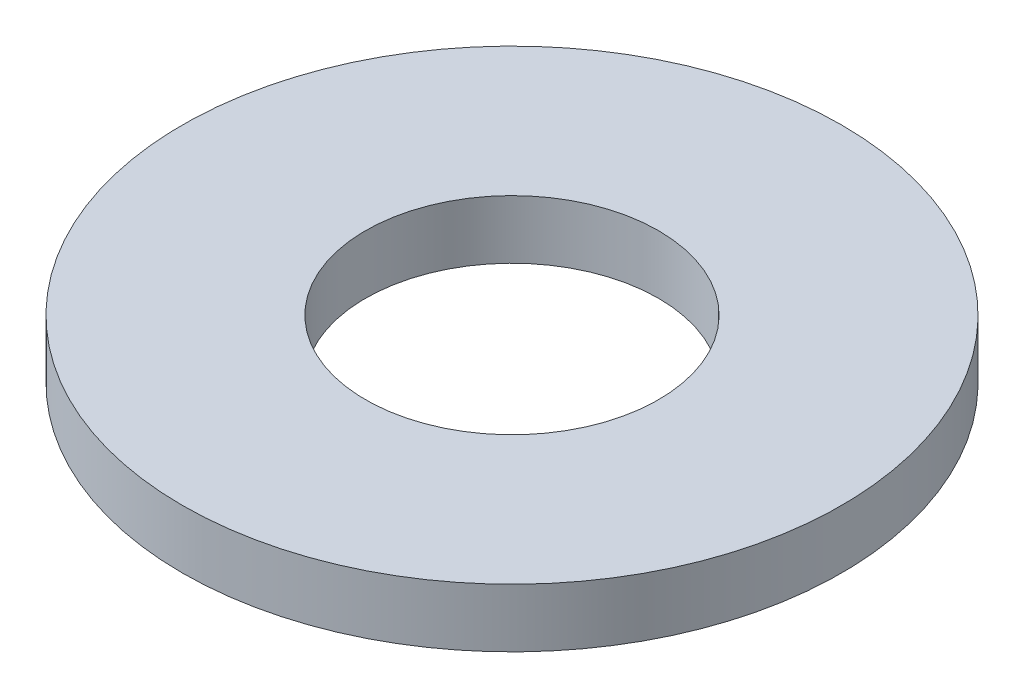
ISO-10303-21;
HEADER;
FILE_DESCRIPTION(('STEP AP214'),'2;1');
FILE_NAME('part.step','',(''),(''),'','','');
FILE_SCHEMA(('AUTOMOTIVE_DESIGN { 1 0 10303 214 1 1 1 1 }'));
ENDSEC;
DATA;
#1=APPLICATION_CONTEXT('core data for automotive mechanical design processes');
#2=APPLICATION_PROTOCOL_DEFINITION('international standard','automotive_design',2000,#1);
#3=PRODUCT_CONTEXT('',#1,'mechanical');
#4=PRODUCT('Part','Part','',(#3));
#5=PRODUCT_RELATED_PRODUCT_CATEGORY('part','',(#4));
#6=PRODUCT_DEFINITION_FORMATION('','',#4);
#7=PRODUCT_DEFINITION_CONTEXT('part definition',#1,'design');
#8=PRODUCT_DEFINITION('design','',#6,#7);
#9=PRODUCT_DEFINITION_SHAPE('','',#8);
#10=(LENGTH_UNIT() NAMED_UNIT(*) SI_UNIT(.MILLI.,.METRE.));
#11=(NAMED_UNIT(*) PLANE_ANGLE_UNIT() SI_UNIT($,.RADIAN.));
#12=(NAMED_UNIT(*) SI_UNIT($,.STERADIAN.) SOLID_ANGLE_UNIT());
#13=UNCERTAINTY_MEASURE_WITH_UNIT(LENGTH_MEASURE(1.E-05),#10,'distance_accuracy_value','');
#14=(GEOMETRIC_REPRESENTATION_CONTEXT(3) GLOBAL_UNCERTAINTY_ASSIGNED_CONTEXT((#13)) GLOBAL_UNIT_ASSIGNED_CONTEXT((#10,
#11,#12)) REPRESENTATION_CONTEXT('',''));
#15=CARTESIAN_POINT('',(0.,0.,0.));
#16=DIRECTION('',(0.,0.,1.));
#17=DIRECTION('',(1.,0.,0.));
#18=AXIS2_PLACEMENT_3D('',#15,#16,#17);
#19=CARTESIAN_POINT('',(4.5,0.8,0.));
#20=DIRECTION('',(0.,1.,0.));
#21=DIRECTION('',(0.,0.,1.));
#22=AXIS2_PLACEMENT_3D('',#19,#20,#21);
#23=PLANE('',#22);
#24=CARTESIAN_POINT('',(0.,0.8,0.));
#25=DIRECTION('',(0.,-1.,0.));
#26=DIRECTION('',(0.,0.,-1.));
#27=AXIS2_PLACEMENT_3D('',#24,#25,#26);
#28=CIRCLE('',#27,2.);
#29=CARTESIAN_POINT('',(0.,0.8,-2.));
#30=VERTEX_POINT('',#29);
#31=EDGE_CURVE('E10',#30,#30,#28,.T.);
#32=ORIENTED_EDGE('',*,*,#31,.T.);
#33=EDGE_LOOP('',(#32));
#34=FACE_BOUND('',#33,.T.);
#35=CARTESIAN_POINT('',(0.,0.8,0.));
#36=DIRECTION('',(0.,-1.,0.));
#37=DIRECTION('',(0.,0.,-1.));
#38=AXIS2_PLACEMENT_3D('',#35,#36,#37);
#39=CIRCLE('',#38,4.5);
#40=CARTESIAN_POINT('',(0.,0.8,-4.5));
#41=VERTEX_POINT('',#40);
#42=EDGE_CURVE('E47',#41,#41,#39,.T.);
#43=ORIENTED_EDGE('',*,*,#42,.F.);
#44=EDGE_LOOP('',(#43));
#45=FACE_BOUND('',#44,.T.);
#46=ADVANCED_FACE('F33',(#34,#45),#23,.T.);
#47=CARTESIAN_POINT('',(0.,0.8,0.));
#48=DIRECTION('',(0.,-1.,0.));
#49=DIRECTION('',(0.,0.,-1.));
#50=AXIS2_PLACEMENT_3D('',#47,#48,#49);
#51=CYLINDRICAL_SURFACE('',#50,2.);
#52=CARTESIAN_POINT('',(0.,0.,0.));
#53=DIRECTION('',(0.,-1.,0.));
#54=DIRECTION('',(0.,0.,-1.));
#55=AXIS2_PLACEMENT_3D('',#52,#53,#54);
#56=CIRCLE('',#55,2.);
#57=CARTESIAN_POINT('',(0.,0.,-2.));
#58=VERTEX_POINT('',#57);
#59=EDGE_CURVE('E39',#58,#58,#56,.T.);
#60=ORIENTED_EDGE('',*,*,#59,.T.);
#61=EDGE_LOOP('',(#60));
#62=FACE_BOUND('',#61,.T.);
#63=ORIENTED_EDGE('',*,*,#31,.F.);
#64=EDGE_LOOP('',(#63));
#65=FACE_BOUND('',#64,.T.);
#66=ADVANCED_FACE('F57',(#62,#65),#51,.F.);
#67=CARTESIAN_POINT('',(2.,0.,0.));
#68=DIRECTION('',(0.,-1.,0.));
#69=DIRECTION('',(0.,0.,-1.));
#70=AXIS2_PLACEMENT_3D('',#67,#68,#69);
#71=PLANE('',#70);
#72=CARTESIAN_POINT('',(0.,0.,0.));
#73=DIRECTION('',(0.,-1.,0.));
#74=DIRECTION('',(0.,0.,-1.));
#75=AXIS2_PLACEMENT_3D('',#72,#73,#74);
#76=CIRCLE('',#75,4.5);
#77=CARTESIAN_POINT('',(0.,0.,-4.5));
#78=VERTEX_POINT('',#77);
#79=EDGE_CURVE('E43',#78,#78,#76,.T.);
#80=ORIENTED_EDGE('',*,*,#79,.T.);
#81=EDGE_LOOP('',(#80));
#82=FACE_BOUND('',#81,.T.);
#83=ORIENTED_EDGE('',*,*,#59,.F.);
#84=EDGE_LOOP('',(#83));
#85=FACE_BOUND('',#84,.T.);
#86=ADVANCED_FACE('F61',(#82,#85),#71,.T.);
#87=CARTESIAN_POINT('',(0.,0.8,0.));
#88=DIRECTION('',(0.,-1.,0.));
#89=DIRECTION('',(0.,0.,-1.));
#90=AXIS2_PLACEMENT_3D('',#87,#88,#89);
#91=CYLINDRICAL_SURFACE('',#90,4.5);
#92=ORIENTED_EDGE('',*,*,#42,.T.);
#93=EDGE_LOOP('',(#92));
#94=FACE_BOUND('',#93,.T.);
#95=ORIENTED_EDGE('',*,*,#79,.F.);
#96=EDGE_LOOP('',(#95));
#97=FACE_BOUND('',#96,.T.);
#98=ADVANCED_FACE('F53',(#94,#97),#91,.T.);
#99=CLOSED_SHELL('',(#46,#66,#86,#98));
#100=MANIFOLD_SOLID_BREP('B2',#99);
#101=ADVANCED_BREP_SHAPE_REPRESENTATION('',(#18,#100),#14);
#102=SHAPE_DEFINITION_REPRESENTATION(#9,#101);
ENDSEC;
END-ISO-10303-21;
